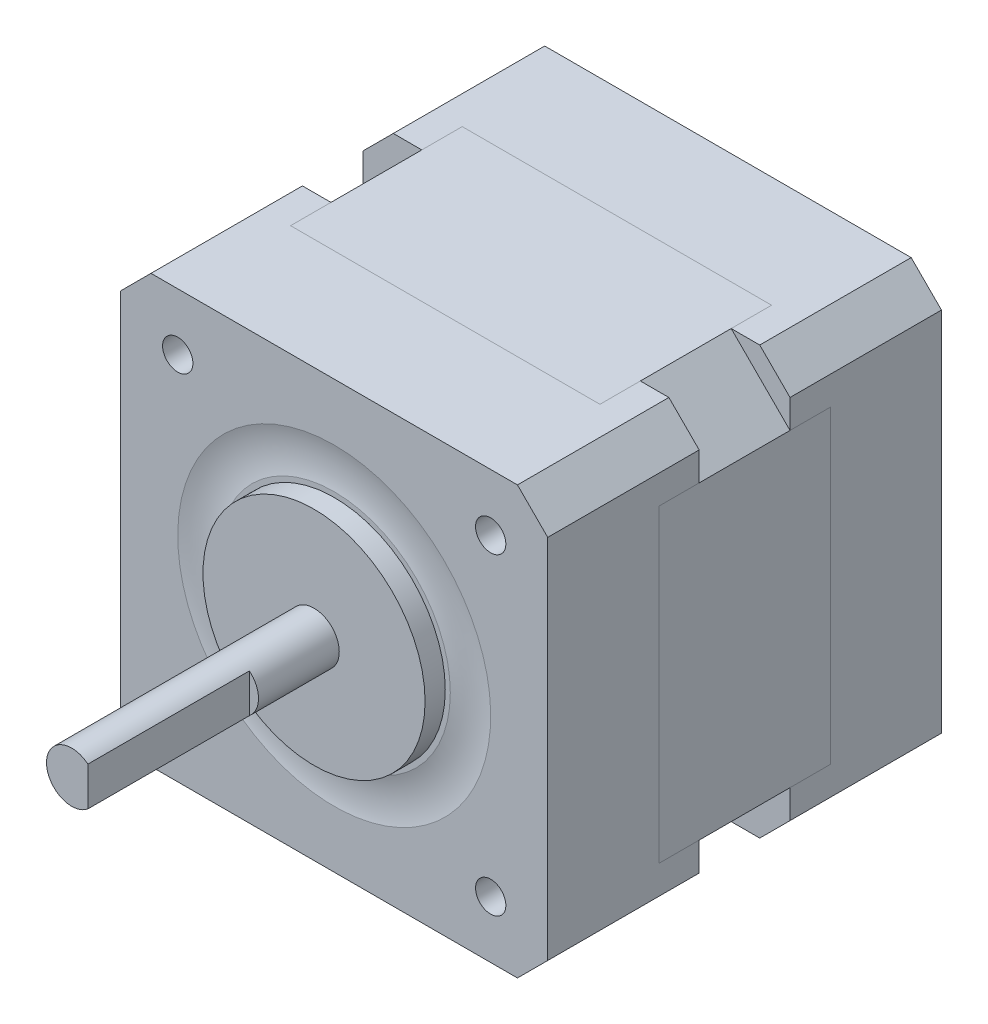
from build123d import *

# Parameters (mm, degrees)
BOSS_EXTRUDE1_DEPTH  = 15
CUT_EXTRUDE1_DEPTH   = 4
BOSS_EXTRUDE7_DEPTH  = 15
CUT_EXTRUDE2_DEPTH   = 4
BOSS_EXTRUDE8_DEPTH  = 17
SKETCH10_R           = 1.5
CUT_EXTRUDE3_DEPTH   = 5.5
SKETCH11_R           = 11
BOSS_EXTRUDE9_DEPTH  = 2
SKETCH12_R           = 2.5
BOSS_EXTRUDE10_DEPTH = 24
CUT_EXTRUDE4_DEPTH   = 16
SKETCH14_R           = 1.5
CUT_EXTRUDE5_DEPTH   = 5.5
SKETCH16_R           = 4
CUT_EXTRUDE6_DEPTH   = 2
SKETCH17_R           = 2.5
BOSS_EXTRUDE11_DEPTH = 1
SKETCH18_R           = 2.75
CUT_EXTRUDE7_DEPTH   = 1


with BuildPart() as part:
    # Sketch1 → Boss-Extrude1 (new body)
    with BuildSketch(Plane.XY):
        Polygon((-21.15, 18.15), (-18.15, 21.15), (18.15, 21.15), (21.15, 18.15), (21.15, -18.15), (18.15, -21.15), (-18.15, -21.15), (-21.15, -18.15), align=None)
    extrude(amount=BOSS_EXTRUDE1_DEPTH)

    # Sketch2 → Cut-Extrude1 (cut)
    with BuildSketch(Plane.XY.offset(15)):
        Polygon((-21.15, 15.321572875), (-15.321572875, 21.15), (15.321572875, 21.15), (21.15, 15.321572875), (21.15, -15.321572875), (15.321572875, -21.15), (-15.321572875, -21.15), (-21.15, -15.321572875), align=None)
    extrude(amount=-CUT_EXTRUDE1_DEPTH, mode=Mode.SUBTRACT)

    # Sketch14 → Cut-Extrude5 (cut)
    with BuildSketch(Plane(origin=(0, 0, 0), x_dir=(-1, 0, 0), z_dir=(0, 0, -1))):
        with Locations(Location((15.5, -15.5, 0), (0, 0, 180))):
            Circle(SKETCH14_R)
        with Locations(Location((-15.5, -15.5, 0), (0, 0, 180))):
            Circle(SKETCH14_R)
        with Locations(Location((-15.5, 15.5, 0), (0, 0, 180))):
            Circle(SKETCH14_R)
        with Locations(Location((15.5, 15.5, 0), (0, 0, 180))):
            Circle(SKETCH14_R)
    extrude(amount=-CUT_EXTRUDE5_DEPTH, mode=Mode.SUBTRACT)

    # Sketch16 → Cut-Extrude6 (cut)
    with BuildSketch(Plane(origin=(0, 0, 0), x_dir=(-1, 0, 0), z_dir=(0, 0, -1))):
        Circle(SKETCH16_R)
    extrude(amount=-CUT_EXTRUDE6_DEPTH, mode=Mode.SUBTRACT)

    # Sketch18 → Cut-Extrude7 (cut)
    with BuildSketch(Plane(origin=(0, 0, 0), x_dir=(-1, 0, 0), z_dir=(0, 0, -1))):
        with Locations((15.5, -15.5)):
            Circle(SKETCH18_R)
        with Locations((-15.5, -15.5)):
            Circle(SKETCH18_R)
        with Locations((-15.5, 15.5)):
            Circle(SKETCH18_R)
        with Locations((15.5, 15.5)):
            Circle(SKETCH18_R)
    extrude(amount=-CUT_EXTRUDE7_DEPTH, mode=Mode.SUBTRACT)


with BuildPart() as body_2:
    # Sketch8 → Boss-Extrude7 (new body)
    with BuildSketch(Plane(origin=(0, 0, 39), x_dir=(-1, 0, 0), z_dir=(0, 0, -1))):
        Polygon((21.15, 18.15), (18.15, 21.15), (-18.15, 21.15), (-21.15, 18.15), (-21.15, -18.15), (-18.15, -21.15), (18.15, -21.15), (21.15, -18.15), align=None)
    extrude(amount=BOSS_EXTRUDE7_DEPTH)

    # Sketch9 → Cut-Extrude2 (cut)
    with BuildSketch(Plane(origin=(0, 0, 24), x_dir=(-1, 0, 0), z_dir=(0, 0, -1))):
        Polygon((15.321572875, -21.15), (21.15, -15.321572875), (21.15, 15.321572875), (15.321572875, 21.15), (-15.321572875, 21.15), (-21.15, 15.321572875), (-21.15, -15.321572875), (-15.321572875, -21.15), align=None)
    extrude(amount=-CUT_EXTRUDE2_DEPTH, mode=Mode.SUBTRACT)

    # Sketch10 → Cut-Extrude3 (cut)
    with BuildSketch(Plane.XY.offset(39)):
        with Locations((-15.5, 15.5)):
            Circle(SKETCH10_R)
        with Locations((15.5, 15.5)):
            Circle(SKETCH10_R)
        with Locations((15.5, -15.5)):
            Circle(SKETCH10_R)
        with Locations((-15.5, -15.5)):
            Circle(SKETCH10_R)
    extrude(amount=-CUT_EXTRUDE3_DEPTH, mode=Mode.SUBTRACT)

    # Sketch15 → Cut-Revolve1 (revolve, cut)
    with BuildSketch(Plane(origin=(0, 0, 0), x_dir=(0, 0, -1), z_dir=(1, 0, 0)), mode=Mode.PRIVATE) as cut_revolve1_sk:
        with BuildLine():
            Line((-39, 11.5), (-39, 15.5))
            ThreePointArc((-39, 15.5), (-38.745966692, 13.5), (-39, 11.5))
        make_face()
    revolve(cut_revolve1_sk.sketch.rotate(Axis((0, 0, 39), (0, 0, 1)), 320.2081805), axis=Axis((0, 0, 39), (0, 0, 1)), mode=Mode.SUBTRACT)


with BuildPart() as body_3:
    # Sketch3 → Boss-Extrude8 (new body)
    with BuildSketch(Plane.XY.offset(11)):
        Polygon((-21.15, -15.321572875), (-15.321572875, -21.15), (15.321572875, -21.15), (21.15, -15.321572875), (21.15, 15.321572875), (15.321572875, 21.15), (-15.321572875, 21.15), (-21.15, 15.321572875), align=None)
    extrude(amount=BOSS_EXTRUDE8_DEPTH)


with BuildPart() as body_4:
    # Sketch11 → Boss-Extrude9 (new body)
    with BuildSketch(Plane.XY.offset(39)):
        Circle(SKETCH11_R)
    extrude(amount=BOSS_EXTRUDE9_DEPTH)


with BuildPart() as body_5:
    # Sketch12 → Boss-Extrude10 (new body)
    with BuildSketch(Plane.XY.offset(41)):
        Circle(SKETCH12_R)
    extrude(amount=BOSS_EXTRUDE10_DEPTH)

    # Sketch13 → Cut-Extrude4 (cut)
    with BuildSketch(Plane.XY.offset(65)):
        with BuildLine():
            Line((1.6, 1.920937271), (1.6, -1.920937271))
            ThreePointArc((1.6, -1.920937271), (2.5, 0), (1.6, 1.920937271))
        make_face()
    extrude(amount=-CUT_EXTRUDE4_DEPTH, mode=Mode.SUBTRACT)


with BuildPart() as body_6:
    # Sketch17 → Boss-Extrude11 (new body)
    with BuildSketch(Plane(origin=(0, 0, 2), x_dir=(-1, 0, 0), z_dir=(0, 0, -1))):
        Circle(SKETCH17_R)
    extrude(amount=BOSS_EXTRUDE11_DEPTH)


solid = Compound([part.part, body_2.part, body_3.part, body_4.part, body_5.part, body_6.part])
